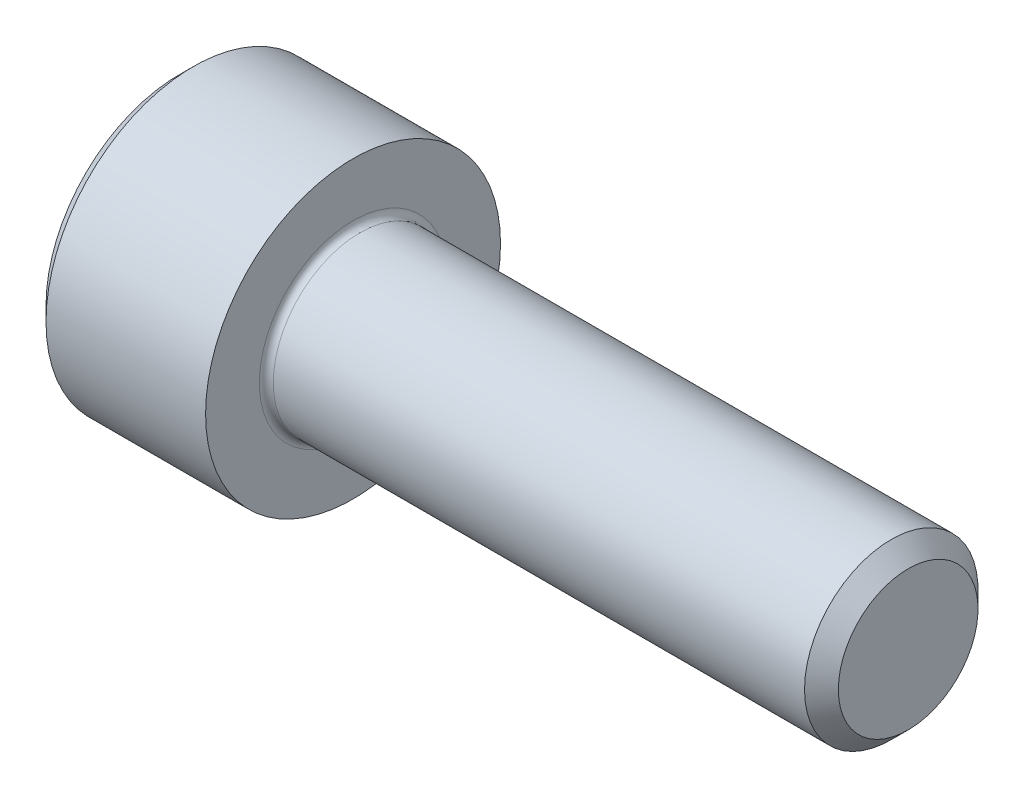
from build123d import *

# Parameters (mm, degrees)
FILLET1_R   = 0.2
HEX_2_DEPTH = 2


with BuildPart() as part:
    # BodySke → Base-Revolve (revolve)
    with BuildSketch(Plane.XY, mode=Mode.PRIVATE) as base_revolve_sk:
        Polygon((0, 0), (0, 3.85), (0.4, 4.25), (5, 4.25), (5, 2.5), (20.5125, 2.5), (21, 2.0125), (21, 0), align=None)
    revolve(base_revolve_sk.sketch.rotate(Axis((-31.75, 0, 0), (1, 0, 0)), 90), axis=Axis((-31.75, 0, 0), (1, 0, 0)))

    # Fillet1
    fillet1_edges = [part.edges().sort_by_distance(p)[0] for p in [
        (5, 0, -2.5),
    ]]
    fillet(fillet1_edges, radius=FILLET1_R)

    # Sketch2 → Hex-PreBroach (revolve, cut)
    with BuildSketch(Plane.XY, mode=Mode.PRIVATE) as hex_prebroach_sk:
        Polygon((0, 1.5355), (2, 1.5355), (2.886521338, 0), (0, 0), align=None)
    revolve(hex_prebroach_sk.sketch.rotate(Axis((0, 0, 0), (1, 0, 0)), 90), axis=Axis((0, 0, 0), (1, 0, 0)), mode=Mode.SUBTRACT)

    # Sketch3 → Hex 2 (cut)
    with BuildSketch(Plane(origin=(0, 0, 0), x_dir=(0, 0.500000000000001, 0.866025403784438), z_dir=(-1, 0, 0))):
        Polygon((0.886521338, 1.5355), (-0.886521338, 1.5355), (-1.773042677, 0), (-0.886521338, -1.5355), (0.886521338, -1.5355), (1.773042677, 0), align=None)
    extrude(amount=-HEX_2_DEPTH, mode=Mode.SUBTRACT)


solid = part.part
